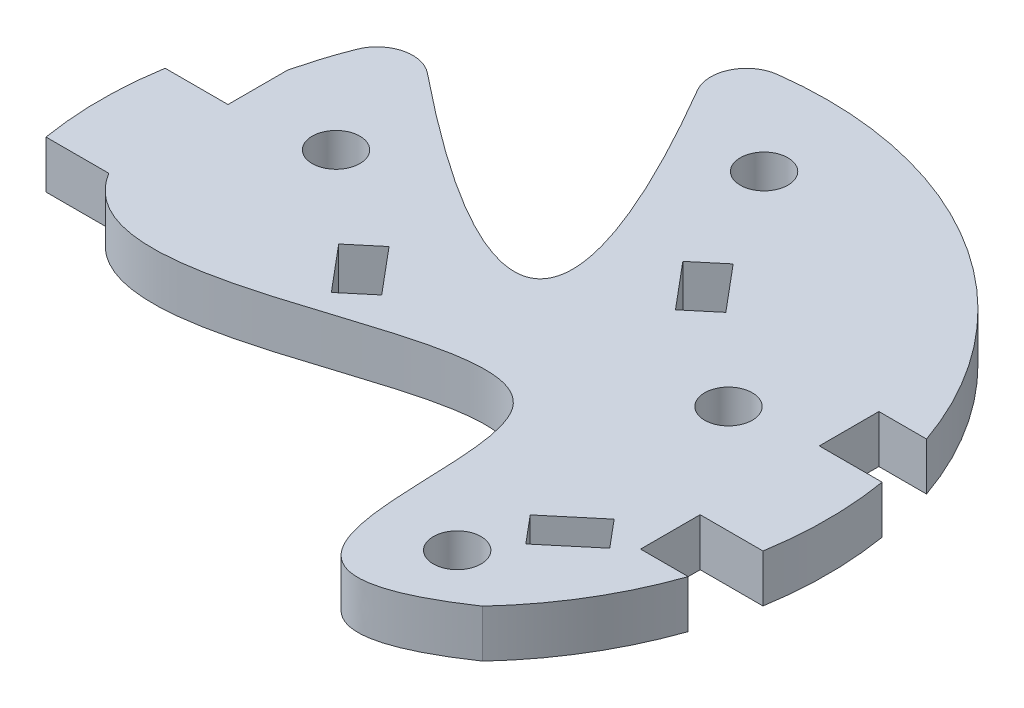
from build123d import *

# Parameters (mm, degrees)
CROQUIS1_R              = 30.5
SALIENTE_EXTRUIR1_DEPTH = 4
CORTAR_EXTRUIR3_START   = -4
CORTAR_EXTRUIR3_DEPTH   = 4
CORTAR_EXTRUIR6_START   = -10
CROQUIS9_R              = 2
CORTAR_EXTRUIR6_DEPTH   = 10
REDONDEO1_R             = 3


with BuildPart() as part:
    # Croquis1 → Saliente-Extruir1 (new body)
    with BuildSketch(Plane(origin=(0, 0, 0), x_dir=(1, 0, 0), z_dir=(0, 1, 0))):
        with Locations(Location((0, 0, 0), (0, 0, 270))):
            Circle(CROQUIS1_R)
    extrude(amount=SALIENTE_EXTRUIR1_DEPTH)

    # Croquis5 → Cortar-Extruir3 (cut)
    with BuildSketch(Plane(origin=(0, 4, 0), x_dir=(1, 0, 0), z_dir=(0, 1, 0)).offset(CORTAR_EXTRUIR3_START)):
        with BuildLine():
            Line((28.814059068, 5), (30.087372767, 5))
            ThreePointArc((30.087372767, 5), (29.556634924, 7.526973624), (28.814059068, 10))
            Line((28.814059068, 10), (24.814059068, 10))
            Line((24.814059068, 10), (24.814059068, 5))
            Line((24.814059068, 5), (28.814059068, 5))
        make_face()
        with BuildLine():
            Line((30.087372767, -5), (28.814059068, -5))
            Line((28.814059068, -5), (24.814059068, -5))
            Line((24.814059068, -5), (24.814059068, -10))
            Line((24.814059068, -10), (28.814059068, -10))
            ThreePointArc((28.814059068, -10), (29.556634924, -7.526973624), (30.087372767, -5))
        make_face()
        with BuildLine():
            Line((-24.814059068, 5), (-24.814059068, 10))
            Line((-24.814059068, 10), (-28.814059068, 10))
            ThreePointArc((-28.814059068, 10), (-29.556634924, 7.526973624), (-30.087372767, 5))
            Line((-30.087372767, 5), (-28.814059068, 5))
            Line((-28.814059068, 5), (-24.814059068, 5))
        make_face()
        with BuildLine():
            Line((-28.814059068, -10), (-24.814059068, -10))
            Line((-24.814059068, -10), (-24.814059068, -5))
            Line((-24.814059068, -5), (-28.814059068, -5))
            Line((-28.814059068, -5), (-30.087372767, -5))
            ThreePointArc((-30.087372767, -5), (-29.556634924, -7.526973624), (-28.814059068, -10))
        make_face()
    extrude(amount=CORTAR_EXTRUIR3_DEPTH, mode=Mode.SUBTRACT)

    # Croquis9 → Cortar-Extruir6 (cut)
    with BuildSketch(Plane(origin=(0, 4, 0), x_dir=(1, 0, 0), z_dir=(0, 1, 0)).offset(CORTAR_EXTRUIR6_START)):
        Polygon((5.673284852, 12.685390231), (8.887222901, 8.855168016), (11.18535623, 10.783530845), (7.971418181, 14.613753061), align=None)
        with BuildLine():
            add(Edge.make_bspline(
                [(22.328940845, -20.776631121), (5.973751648, -31.851207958), (22.176782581, 15.835204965), (-18.206868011, -15.807645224), (-24.814059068, -5)],
                knots=[0, 0, 0, 0, 0.445790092, 1, 1, 1, 1], degree=3))
            Line((-24.814059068, -5), (-24.814059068, -10))
            Line((-24.814059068, -10), (-28.814059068, -10))
            ThreePointArc((-28.814059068, -10), (-6.288730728, -29.84462876), (22.328940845, -20.776631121))
        make_face()
        with BuildLine():
            add(Edge.make_bspline(
                [(-18.745320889, 15.664553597), (3.867000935, -2.576496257), (8.094246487, 2.496379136), (-8.307345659, 29.346856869)],
                knots=[0.040527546, 0.040527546, 0.040527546, 0.040527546, 1, 1, 1, 1], degree=3))
            ThreePointArc((-8.307345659, 29.346856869), (-20.930238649, 22.185019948), (-28.814059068, 10))
            Line((-28.814059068, 10), (-24.814059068, 10))
            add(Edge.make_bspline(
                [(-24.814059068, 10), (-24.456478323, 11.504954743), (-23.99064654, 12.985671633), (-23.418905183, 14.432273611)],
                knots=[0.635079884, 0.635079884, 0.635079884, 0.635079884, 0.831813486, 0.831813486, 0.831813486, 0.831813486], degree=3))
            ThreePointArc((-23.418905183, 14.432273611), (-21.393777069, 16.230440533), (-18.745320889, 15.664553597))
        make_face()
        Polygon((-4.518554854, -2.393615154), (-7.732492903, 1.436607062), (-10.030626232, -0.491755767), (-6.816688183, -4.321977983), align=None)
        Polygon((23.455638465, -11.229310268), (21.527275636, -8.931176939), (17.69705342, -12.145114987), (19.625416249, -14.443248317), align=None)
        with Locations(Location((2.550631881, 22.629718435, 0), (0, 0, 270))):
            Circle(CROQUIS9_R)
        with Locations(Location((18.138231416, 4.05314069, 0), (0, 0, 270))):
            Circle(CROQUIS9_R)
        with Locations(Location((-16.983501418, 6.238634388, 0), (0, 0, 270))):
            Circle(CROQUIS9_R)
        with Locations(Location((17.204026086, -17.780443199, 0), (0, 0, 270))):
            Circle(CROQUIS9_R)
    extrude(amount=CORTAR_EXTRUIR6_DEPTH, mode=Mode.SUBTRACT)

    # Redondeo1
    redondeo1_edges = [part.edges().sort_by_distance(p)[0] for p in [
        (-8.307345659, 2, -29.346856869),
    ]]
    fillet(redondeo1_edges, radius=REDONDEO1_R)


solid = part.part
